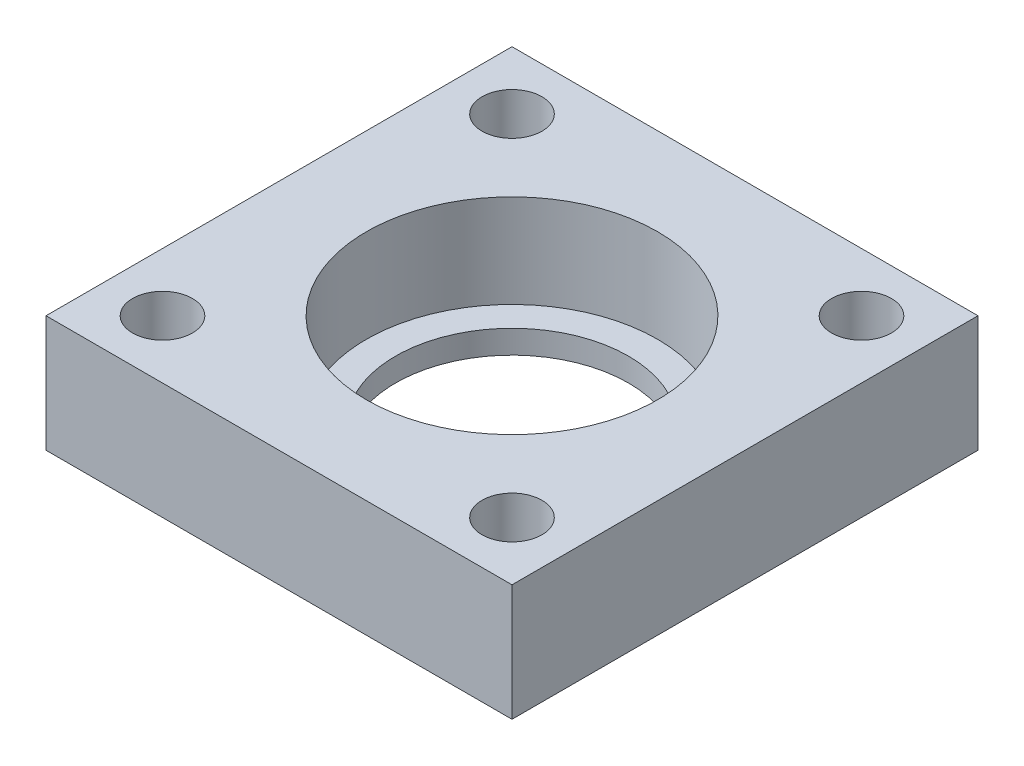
ISO-10303-21;
HEADER;
FILE_DESCRIPTION(('STEP AP214'),'2;1');
FILE_NAME('part.step','',(''),(''),'','','');
FILE_SCHEMA(('AUTOMOTIVE_DESIGN { 1 0 10303 214 1 1 1 1 }'));
ENDSEC;
DATA;
#1=APPLICATION_CONTEXT('core data for automotive mechanical design processes');
#2=APPLICATION_PROTOCOL_DEFINITION('international standard','automotive_design',2000,#1);
#3=PRODUCT_CONTEXT('',#1,'mechanical');
#4=PRODUCT('Part','Part','',(#3));
#5=PRODUCT_RELATED_PRODUCT_CATEGORY('part','',(#4));
#6=PRODUCT_DEFINITION_FORMATION('','',#4);
#7=PRODUCT_DEFINITION_CONTEXT('part definition',#1,'design');
#8=PRODUCT_DEFINITION('design','',#6,#7);
#9=PRODUCT_DEFINITION_SHAPE('','',#8);
#10=(LENGTH_UNIT() NAMED_UNIT(*) SI_UNIT(.MILLI.,.METRE.));
#11=(NAMED_UNIT(*) PLANE_ANGLE_UNIT() SI_UNIT($,.RADIAN.));
#12=(NAMED_UNIT(*) SI_UNIT($,.STERADIAN.) SOLID_ANGLE_UNIT());
#13=UNCERTAINTY_MEASURE_WITH_UNIT(LENGTH_MEASURE(1.E-05),#10,'distance_accuracy_value','');
#14=(GEOMETRIC_REPRESENTATION_CONTEXT(3) GLOBAL_UNCERTAINTY_ASSIGNED_CONTEXT((#13)) GLOBAL_UNIT_ASSIGNED_CONTEXT((#10,
#11,#12)) REPRESENTATION_CONTEXT('',''));
#15=CARTESIAN_POINT('',(0.,0.,0.));
#16=DIRECTION('',(0.,0.,1.));
#17=DIRECTION('',(1.,0.,0.));
#18=AXIS2_PLACEMENT_3D('',#15,#16,#17);
#19=CARTESIAN_POINT('',(0.,-6.35,0.));
#20=DIRECTION('',(-1.,0.,0.));
#21=DIRECTION('',(0.,0.,1.));
#22=AXIS2_PLACEMENT_3D('',#19,#20,#21);
#23=PLANE('',#22);
#24=DIRECTION('',(0.,0.,1.));
#25=VECTOR('',#24,1.);
#26=CARTESIAN_POINT('',(0.,0.,0.));
#27=LINE('',#26,#25);
#28=CARTESIAN_POINT('',(0.,0.,-25.4));
#29=VERTEX_POINT('',#28);
#30=CARTESIAN_POINT('',(0.,0.,0.));
#31=VERTEX_POINT('',#30);
#32=EDGE_CURVE('E99',#29,#31,#27,.T.);
#33=ORIENTED_EDGE('',*,*,#32,.F.);
#34=DIRECTION('',(0.,1.,0.));
#35=VECTOR('',#34,1.);
#36=CARTESIAN_POINT('',(0.,-6.35,-25.4));
#37=LINE('',#36,#35);
#38=CARTESIAN_POINT('',(0.,-6.35,-25.4));
#39=VERTEX_POINT('',#38);
#40=EDGE_CURVE('E11',#39,#29,#37,.T.);
#41=ORIENTED_EDGE('',*,*,#40,.F.);
#42=DIRECTION('',(0.,0.,1.));
#43=VECTOR('',#42,1.);
#44=CARTESIAN_POINT('',(0.,-6.35,0.));
#45=LINE('',#44,#43);
#46=CARTESIAN_POINT('',(0.,-6.35,0.));
#47=VERTEX_POINT('',#46);
#48=EDGE_CURVE('E92',#39,#47,#45,.T.);
#49=ORIENTED_EDGE('',*,*,#48,.T.);
#50=DIRECTION('',(0.,1.,0.));
#51=VECTOR('',#50,1.);
#52=CARTESIAN_POINT('',(0.,-6.35,0.));
#53=LINE('',#52,#51);
#54=EDGE_CURVE('E37',#47,#31,#53,.T.);
#55=ORIENTED_EDGE('',*,*,#54,.T.);
#56=EDGE_LOOP('',(#33,#41,#49,#55));
#57=FACE_BOUND('',#56,.T.);
#58=ADVANCED_FACE('F34',(#57),#23,.T.);
#59=CARTESIAN_POINT('',(0.,-6.35,-25.4));
#60=DIRECTION('',(0.,0.,-1.));
#61=DIRECTION('',(-1.,0.,0.));
#62=AXIS2_PLACEMENT_3D('',#59,#60,#61);
#63=PLANE('',#62);
#64=DIRECTION('',(-1.,0.,0.));
#65=VECTOR('',#64,1.);
#66=CARTESIAN_POINT('',(0.,0.,-25.4));
#67=LINE('',#66,#65);
#68=CARTESIAN_POINT('',(25.4,0.,-25.4));
#69=VERTEX_POINT('',#68);
#70=EDGE_CURVE('E94',#69,#29,#67,.T.);
#71=ORIENTED_EDGE('',*,*,#70,.F.);
#72=DIRECTION('',(0.,1.,0.));
#73=VECTOR('',#72,1.);
#74=CARTESIAN_POINT('',(25.4,-6.35,-25.4));
#75=LINE('',#74,#73);
#76=CARTESIAN_POINT('',(25.4,-6.35,-25.4));
#77=VERTEX_POINT('',#76);
#78=EDGE_CURVE('E43',#77,#69,#75,.T.);
#79=ORIENTED_EDGE('',*,*,#78,.F.);
#80=DIRECTION('',(-1.,0.,0.));
#81=VECTOR('',#80,1.);
#82=CARTESIAN_POINT('',(0.,-6.35,-25.4));
#83=LINE('',#82,#81);
#84=EDGE_CURVE('E89',#77,#39,#83,.T.);
#85=ORIENTED_EDGE('',*,*,#84,.T.);
#86=ORIENTED_EDGE('',*,*,#40,.T.);
#87=EDGE_LOOP('',(#71,#79,#85,#86));
#88=FACE_BOUND('',#87,.T.);
#89=ADVANCED_FACE('F110',(#88),#63,.T.);
#90=CARTESIAN_POINT('',(25.4,-6.35,0.));
#91=DIRECTION('',(1.,0.,0.));
#92=DIRECTION('',(0.,0.,-1.));
#93=AXIS2_PLACEMENT_3D('',#90,#91,#92);
#94=PLANE('',#93);
#95=DIRECTION('',(0.,0.,-1.));
#96=VECTOR('',#95,1.);
#97=CARTESIAN_POINT('',(25.4,0.,0.));
#98=LINE('',#97,#96);
#99=CARTESIAN_POINT('',(25.4,0.,0.));
#100=VERTEX_POINT('',#99);
#101=EDGE_CURVE('E84',#100,#69,#98,.T.);
#102=ORIENTED_EDGE('',*,*,#101,.F.);
#103=DIRECTION('',(0.,1.,0.));
#104=VECTOR('',#103,1.);
#105=CARTESIAN_POINT('',(25.4,-6.35,0.));
#106=LINE('',#105,#104);
#107=CARTESIAN_POINT('',(25.4,-6.35,0.));
#108=VERTEX_POINT('',#107);
#109=EDGE_CURVE('E79',#108,#100,#106,.T.);
#110=ORIENTED_EDGE('',*,*,#109,.F.);
#111=DIRECTION('',(0.,0.,-1.));
#112=VECTOR('',#111,1.);
#113=CARTESIAN_POINT('',(25.4,-6.35,0.));
#114=LINE('',#113,#112);
#115=EDGE_CURVE('E82',#108,#77,#114,.T.);
#116=ORIENTED_EDGE('',*,*,#115,.T.);
#117=ORIENTED_EDGE('',*,*,#78,.T.);
#118=EDGE_LOOP('',(#102,#110,#116,#117));
#119=FACE_BOUND('',#118,.T.);
#120=ADVANCED_FACE('F81',(#119),#94,.T.);
#121=CARTESIAN_POINT('',(0.,-6.35,0.));
#122=DIRECTION('',(0.,0.,1.));
#123=DIRECTION('',(1.,0.,0.));
#124=AXIS2_PLACEMENT_3D('',#121,#122,#123);
#125=PLANE('',#124);
#126=DIRECTION('',(1.,0.,0.));
#127=VECTOR('',#126,1.);
#128=CARTESIAN_POINT('',(0.,0.,0.));
#129=LINE('',#128,#127);
#130=EDGE_CURVE('E102',#31,#100,#129,.T.);
#131=ORIENTED_EDGE('',*,*,#130,.F.);
#132=ORIENTED_EDGE('',*,*,#54,.F.);
#133=DIRECTION('',(1.,0.,0.));
#134=VECTOR('',#133,1.);
#135=CARTESIAN_POINT('',(0.,-6.35,0.));
#136=LINE('',#135,#134);
#137=EDGE_CURVE('E88',#47,#108,#136,.T.);
#138=ORIENTED_EDGE('',*,*,#137,.T.);
#139=ORIENTED_EDGE('',*,*,#109,.T.);
#140=EDGE_LOOP('',(#131,#132,#138,#139));
#141=FACE_BOUND('',#140,.T.);
#142=ADVANCED_FACE('F91',(#141),#125,.T.);
#143=CARTESIAN_POINT('',(0.,-6.35,-25.4));
#144=DIRECTION('',(0.,-1.,0.));
#145=DIRECTION('',(0.,0.,-1.));
#146=AXIS2_PLACEMENT_3D('',#143,#144,#145);
#147=PLANE('',#146);
#148=CARTESIAN_POINT('',(22.2249999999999,-6.35,-22.2250000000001));
#149=DIRECTION('',(0.,-1.,0.));
#150=DIRECTION('',(0.,0.,-1.));
#151=AXIS2_PLACEMENT_3D('',#148,#149,#150);
#152=CIRCLE('',#151,1.63195);
#153=CARTESIAN_POINT('',(22.2249999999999,-6.35,-23.8569500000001));
#154=VERTEX_POINT('',#153);
#155=EDGE_CURVE('E163',#154,#154,#152,.T.);
#156=ORIENTED_EDGE('',*,*,#155,.F.);
#157=EDGE_LOOP('',(#156));
#158=FACE_BOUND('',#157,.T.);
#159=CARTESIAN_POINT('',(22.2250000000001,-6.35,-3.17500000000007));
#160=DIRECTION('',(0.,-1.,0.));
#161=DIRECTION('',(0.,0.,-1.));
#162=AXIS2_PLACEMENT_3D('',#159,#160,#161);
#163=CIRCLE('',#162,1.63195);
#164=CARTESIAN_POINT('',(22.2250000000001,-6.35,-4.80695000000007));
#165=VERTEX_POINT('',#164);
#166=EDGE_CURVE('E173',#165,#165,#163,.T.);
#167=ORIENTED_EDGE('',*,*,#166,.F.);
#168=EDGE_LOOP('',(#167));
#169=FACE_BOUND('',#168,.T.);
#170=CARTESIAN_POINT('',(3.17500000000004,-6.35,-3.17499999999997));
#171=DIRECTION('',(0.,-1.,0.));
#172=DIRECTION('',(0.,0.,-1.));
#173=AXIS2_PLACEMENT_3D('',#170,#171,#172);
#174=CIRCLE('',#173,1.63195);
#175=CARTESIAN_POINT('',(3.17500000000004,-6.35,-4.80694999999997));
#176=VERTEX_POINT('',#175);
#177=EDGE_CURVE('E179',#176,#176,#174,.T.);
#178=ORIENTED_EDGE('',*,*,#177,.F.);
#179=EDGE_LOOP('',(#178));
#180=FACE_BOUND('',#179,.T.);
#181=CARTESIAN_POINT('',(3.175,-6.35,-22.225));
#182=DIRECTION('',(0.,-1.,0.));
#183=DIRECTION('',(0.,0.,-1.));
#184=AXIS2_PLACEMENT_3D('',#181,#182,#183);
#185=CIRCLE('',#184,1.63195);
#186=CARTESIAN_POINT('',(3.175,-6.35,-23.85695));
#187=VERTEX_POINT('',#186);
#188=EDGE_CURVE('E185',#187,#187,#185,.T.);
#189=ORIENTED_EDGE('',*,*,#188,.F.);
#190=EDGE_LOOP('',(#189));
#191=FACE_BOUND('',#190,.T.);
#192=CARTESIAN_POINT('',(12.7,-6.35,-12.7));
#193=DIRECTION('',(0.,-1.,0.));
#194=DIRECTION('',(0.,0.,-1.));
#195=AXIS2_PLACEMENT_3D('',#192,#193,#194);
#196=CIRCLE('',#195,6.35);
#197=CARTESIAN_POINT('',(12.7,-6.35,-19.05));
#198=VERTEX_POINT('',#197);
#199=EDGE_CURVE('E191',#198,#198,#196,.F.);
#200=ORIENTED_EDGE('',*,*,#199,.T.);
#201=EDGE_LOOP('',(#200));
#202=FACE_BOUND('',#201,.T.);
#203=ORIENTED_EDGE('',*,*,#48,.F.);
#204=ORIENTED_EDGE('',*,*,#84,.F.);
#205=ORIENTED_EDGE('',*,*,#115,.F.);
#206=ORIENTED_EDGE('',*,*,#137,.F.);
#207=EDGE_LOOP('',(#203,#204,#205,#206));
#208=FACE_BOUND('',#207,.T.);
#209=ADVANCED_FACE('F87',(#158,#169,#180,#191,#202,#208),#147,.T.);
#210=CARTESIAN_POINT('',(0.,0.,-25.4));
#211=DIRECTION('',(0.,-1.,0.));
#212=DIRECTION('',(0.,0.,-1.));
#213=AXIS2_PLACEMENT_3D('',#210,#211,#212);
#214=PLANE('',#213);
#215=CARTESIAN_POINT('',(22.2249999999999,0.,-22.2250000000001));
#216=DIRECTION('',(0.,1.,0.));
#217=DIRECTION('',(0.,0.,1.));
#218=AXIS2_PLACEMENT_3D('',#215,#216,#217);
#219=CIRCLE('',#218,1.63195);
#220=CARTESIAN_POINT('',(22.2249999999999,0.,-20.5930500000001));
#221=VERTEX_POINT('',#220);
#222=EDGE_CURVE('E166',#221,#221,#219,.T.);
#223=ORIENTED_EDGE('',*,*,#222,.F.);
#224=EDGE_LOOP('',(#223));
#225=FACE_BOUND('',#224,.T.);
#226=CARTESIAN_POINT('',(22.2250000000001,0.,-3.17500000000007));
#227=DIRECTION('',(0.,1.,0.));
#228=DIRECTION('',(0.,0.,1.));
#229=AXIS2_PLACEMENT_3D('',#226,#227,#228);
#230=CIRCLE('',#229,1.63195);
#231=CARTESIAN_POINT('',(22.2250000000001,0.,-1.54305000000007));
#232=VERTEX_POINT('',#231);
#233=EDGE_CURVE('E168',#232,#232,#230,.T.);
#234=ORIENTED_EDGE('',*,*,#233,.F.);
#235=EDGE_LOOP('',(#234));
#236=FACE_BOUND('',#235,.T.);
#237=CARTESIAN_POINT('',(3.17500000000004,0.,-3.17499999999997));
#238=DIRECTION('',(0.,1.,0.));
#239=DIRECTION('',(0.,0.,1.));
#240=AXIS2_PLACEMENT_3D('',#237,#238,#239);
#241=CIRCLE('',#240,1.63195);
#242=CARTESIAN_POINT('',(3.17500000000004,0.,-1.54304999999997));
#243=VERTEX_POINT('',#242);
#244=EDGE_CURVE('E176',#243,#243,#241,.T.);
#245=ORIENTED_EDGE('',*,*,#244,.F.);
#246=EDGE_LOOP('',(#245));
#247=FACE_BOUND('',#246,.T.);
#248=CARTESIAN_POINT('',(3.175,0.,-22.225));
#249=DIRECTION('',(0.,1.,0.));
#250=DIRECTION('',(0.,0.,1.));
#251=AXIS2_PLACEMENT_3D('',#248,#249,#250);
#252=CIRCLE('',#251,1.63195);
#253=CARTESIAN_POINT('',(3.175,0.,-20.59305));
#254=VERTEX_POINT('',#253);
#255=EDGE_CURVE('E182',#254,#254,#252,.T.);
#256=ORIENTED_EDGE('',*,*,#255,.F.);
#257=EDGE_LOOP('',(#256));
#258=FACE_BOUND('',#257,.T.);
#259=CARTESIAN_POINT('',(12.7,0.,-12.7));
#260=DIRECTION('',(0.,1.,0.));
#261=DIRECTION('',(0.,0.,1.));
#262=AXIS2_PLACEMENT_3D('',#259,#260,#261);
#263=CIRCLE('',#262,7.9375);
#264=CARTESIAN_POINT('',(12.7,0.,-4.7625));
#265=VERTEX_POINT('',#264);
#266=EDGE_CURVE('E194',#265,#265,#263,.T.);
#267=ORIENTED_EDGE('',*,*,#266,.F.);
#268=EDGE_LOOP('',(#267));
#269=FACE_BOUND('',#268,.T.);
#270=ORIENTED_EDGE('',*,*,#32,.T.);
#271=ORIENTED_EDGE('',*,*,#130,.T.);
#272=ORIENTED_EDGE('',*,*,#101,.T.);
#273=ORIENTED_EDGE('',*,*,#70,.T.);
#274=EDGE_LOOP('',(#270,#271,#272,#273));
#275=FACE_BOUND('',#274,.T.);
#276=ADVANCED_FACE('F109',(#225,#236,#247,#258,#269,#275),#214,.F.);
#277=CARTESIAN_POINT('',(12.7,-5.08,-12.7));
#278=DIRECTION('',(0.,1.,0.));
#279=DIRECTION('',(0.,0.,1.));
#280=AXIS2_PLACEMENT_3D('',#277,#278,#279);
#281=CYLINDRICAL_SURFACE('',#280,7.9375);
#282=CARTESIAN_POINT('',(12.7,-5.08,-12.7));
#283=DIRECTION('',(0.,1.,0.));
#284=DIRECTION('',(0.,0.,1.));
#285=AXIS2_PLACEMENT_3D('',#282,#283,#284);
#286=CIRCLE('',#285,7.9375);
#287=CARTESIAN_POINT('',(12.7,-5.08,-4.7625));
#288=VERTEX_POINT('',#287);
#289=EDGE_CURVE('E103',#288,#288,#286,.T.);
#290=ORIENTED_EDGE('',*,*,#289,.F.);
#291=EDGE_LOOP('',(#290));
#292=FACE_BOUND('',#291,.T.);
#293=ORIENTED_EDGE('',*,*,#266,.T.);
#294=EDGE_LOOP('',(#293));
#295=FACE_BOUND('',#294,.T.);
#296=ADVANCED_FACE('F128',(#292,#295),#281,.F.);
#297=CARTESIAN_POINT('',(12.7,-5.08,-12.7));
#298=DIRECTION('',(0.,1.,0.));
#299=DIRECTION('',(0.,0.,1.));
#300=AXIS2_PLACEMENT_3D('',#297,#298,#299);
#301=PLANE('',#300);
#302=CARTESIAN_POINT('',(12.7,-5.08,-12.7));
#303=DIRECTION('',(0.,1.,0.));
#304=DIRECTION('',(0.,0.,1.));
#305=AXIS2_PLACEMENT_3D('',#302,#303,#304);
#306=CIRCLE('',#305,6.35);
#307=CARTESIAN_POINT('',(12.7,-5.08,-6.35));
#308=VERTEX_POINT('',#307);
#309=EDGE_CURVE('E188',#308,#308,#306,.T.);
#310=ORIENTED_EDGE('',*,*,#309,.F.);
#311=EDGE_LOOP('',(#310));
#312=FACE_BOUND('',#311,.T.);
#313=ORIENTED_EDGE('',*,*,#289,.T.);
#314=EDGE_LOOP('',(#313));
#315=FACE_BOUND('',#314,.T.);
#316=ADVANCED_FACE('F135',(#312,#315),#301,.T.);
#317=CARTESIAN_POINT('',(12.7,-24.3105122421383,-12.7));
#318=DIRECTION('',(0.,1.,0.));
#319=DIRECTION('',(0.,0.,1.));
#320=AXIS2_PLACEMENT_3D('',#317,#318,#319);
#321=CYLINDRICAL_SURFACE('',#320,6.35);
#322=ORIENTED_EDGE('',*,*,#309,.T.);
#323=EDGE_LOOP('',(#322));
#324=FACE_BOUND('',#323,.T.);
#325=ORIENTED_EDGE('',*,*,#199,.F.);
#326=EDGE_LOOP('',(#325));
#327=FACE_BOUND('',#326,.T.);
#328=ADVANCED_FACE('F139',(#324,#327),#321,.F.);
#329=CARTESIAN_POINT('',(3.175,0.,-22.225));
#330=DIRECTION('',(0.,1.,0.));
#331=DIRECTION('',(0.,0.,1.));
#332=AXIS2_PLACEMENT_3D('',#329,#330,#331);
#333=CYLINDRICAL_SURFACE('',#332,1.63195);
#334=ORIENTED_EDGE('',*,*,#188,.T.);
#335=EDGE_LOOP('',(#334));
#336=FACE_BOUND('',#335,.T.);
#337=ORIENTED_EDGE('',*,*,#255,.T.);
#338=EDGE_LOOP('',(#337));
#339=FACE_BOUND('',#338,.T.);
#340=ADVANCED_FACE('F143',(#336,#339),#333,.F.);
#341=CARTESIAN_POINT('',(3.17500000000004,0.,-3.17499999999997));
#342=DIRECTION('',(0.,1.,0.));
#343=DIRECTION('',(0.,0.,1.));
#344=AXIS2_PLACEMENT_3D('',#341,#342,#343);
#345=CYLINDRICAL_SURFACE('',#344,1.63195);
#346=ORIENTED_EDGE('',*,*,#177,.T.);
#347=EDGE_LOOP('',(#346));
#348=FACE_BOUND('',#347,.T.);
#349=ORIENTED_EDGE('',*,*,#244,.T.);
#350=EDGE_LOOP('',(#349));
#351=FACE_BOUND('',#350,.T.);
#352=ADVANCED_FACE('F147',(#348,#351),#345,.F.);
#353=CARTESIAN_POINT('',(22.2250000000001,0.,-3.17500000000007));
#354=DIRECTION('',(0.,1.,0.));
#355=DIRECTION('',(0.,0.,1.));
#356=AXIS2_PLACEMENT_3D('',#353,#354,#355);
#357=CYLINDRICAL_SURFACE('',#356,1.63195);
#358=ORIENTED_EDGE('',*,*,#166,.T.);
#359=EDGE_LOOP('',(#358));
#360=FACE_BOUND('',#359,.T.);
#361=ORIENTED_EDGE('',*,*,#233,.T.);
#362=EDGE_LOOP('',(#361));
#363=FACE_BOUND('',#362,.T.);
#364=ADVANCED_FACE('F151',(#360,#363),#357,.F.);
#365=CARTESIAN_POINT('',(22.2249999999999,0.,-22.2250000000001));
#366=DIRECTION('',(0.,1.,0.));
#367=DIRECTION('',(0.,0.,1.));
#368=AXIS2_PLACEMENT_3D('',#365,#366,#367);
#369=CYLINDRICAL_SURFACE('',#368,1.63195);
#370=ORIENTED_EDGE('',*,*,#155,.T.);
#371=EDGE_LOOP('',(#370));
#372=FACE_BOUND('',#371,.T.);
#373=ORIENTED_EDGE('',*,*,#222,.T.);
#374=EDGE_LOOP('',(#373));
#375=FACE_BOUND('',#374,.T.);
#376=ADVANCED_FACE('F155',(#372,#375),#369,.F.);
#377=CLOSED_SHELL('',(#58,#89,#120,#142,#209,#276,#296,#316,#328,#340,#352,#364,#376));
#378=MANIFOLD_SOLID_BREP('B2',#377);
#379=ADVANCED_BREP_SHAPE_REPRESENTATION('',(#18,#378),#14);
#380=SHAPE_DEFINITION_REPRESENTATION(#9,#379);
ENDSEC;
END-ISO-10303-21;
